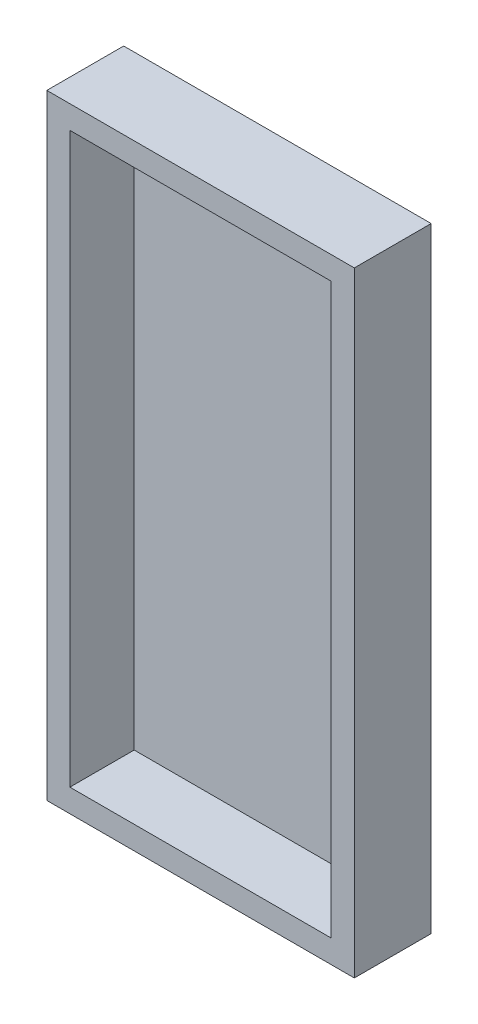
from build123d import *

# Parameters (mm, degrees)
SALIENTE_EXTRUIR1_DEPTH      = 8
SALIENTE_EXTRUIR1_DEPTH_BACK = 2
CROQUIS1_W                   = 40
CROQUIS1_H                   = 80
CROQUIS2_W                   = 34
CROQUIS2_H                   = 74
CORTAR_EXTRUIR1_DEPTH        = 8.363170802


with BuildPart() as part:
    # Croquis1 → Saliente-Extruir1 (new, two sides: drawn at the far end of the back side and taken through both)
    with BuildSketch(Plane.XY.offset(-SALIENTE_EXTRUIR1_DEPTH_BACK)):
        Rectangle(CROQUIS1_W, CROQUIS1_H)
    extrude(amount=SALIENTE_EXTRUIR1_DEPTH + SALIENTE_EXTRUIR1_DEPTH_BACK)

    # Croquis2 → Cortar-Extruir1 (cut)
    with BuildSketch(Plane.XY.offset(8)):
        Rectangle(CROQUIS2_W, CROQUIS2_H)
    extrude(amount=-CORTAR_EXTRUIR1_DEPTH, mode=Mode.SUBTRACT)


solid = part.part
